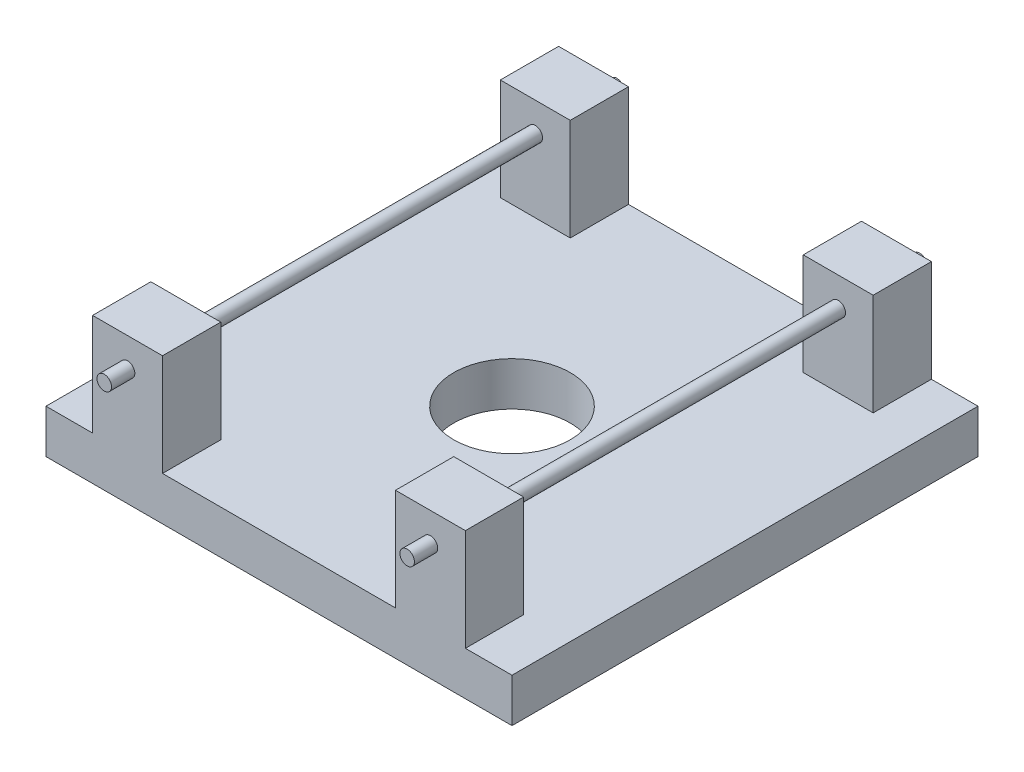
from build123d import *

# Parameters (mm, degrees)
SKETCH3_W                = 50.8
SKETCH3_H                = 50.8
BOSS_EXTRUDE2_DEPTH      = 4.7625
SKETCH4_R                = 6.35
CUT_EXTRUDE2_DEPTH       = 37.235361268
SKETCH5_W                = 7.62
SKETCH5_H                = 50.8
BOSS_EXTRUDE3_DEPTH      = 11.1125
SKETCH6_W                = 7.62
SKETCH6_H                = 38.1
CUT_EXTRUDE3_DEPTH       = 11.1125
BOSS_EXTRUDE4_DEPTH      = 2.54
BOSS_EXTRUDE4_DEPTH_BACK = 53.34
SKETCH7_R                = 0.79375


with BuildPart() as part:
    # Sketch3 → Boss-Extrude2 (new body)
    with BuildSketch(Plane(origin=(0, 0, 0), x_dir=(1, 0, 0), z_dir=(0, 1, 0))):
        Rectangle(SKETCH3_W, SKETCH3_H)
    extrude(amount=BOSS_EXTRUDE2_DEPTH)

    # Sketch4 → Cut-Extrude2 (cut, through all)
    with BuildSketch(Plane(origin=(0, 4.7625, 0), x_dir=(1, 0, 0), z_dir=(0, 1, 0))):
        with Locations(Location((0, 0, 0), (0, 0, 270))):
            Circle(SKETCH4_R)
    extrude(amount=-CUT_EXTRUDE2_DEPTH, mode=Mode.SUBTRACT)

    # Sketch5 → Boss-Extrude3 (add)
    with BuildSketch(Plane(origin=(0, 4.7625, 0), x_dir=(1, 0, 0), z_dir=(0, 1, 0))):
        with Locations((-16.51, 0)):
            Rectangle(SKETCH5_W, SKETCH5_H)
        with Locations((16.51, 0)):
            Rectangle(SKETCH5_W, SKETCH5_H)
    extrude(amount=BOSS_EXTRUDE3_DEPTH)

    # Sketch6 → Cut-Extrude3 (cut)
    with BuildSketch(Plane(origin=(0, 15.875, 0), x_dir=(1, 0, 0), z_dir=(0, 1, 0))):
        with Locations((16.51, 0)):
            Rectangle(SKETCH6_W, SKETCH6_H)
        with Locations((-16.51, 0)):
            Rectangle(SKETCH6_W, SKETCH6_H)
    extrude(amount=-CUT_EXTRUDE3_DEPTH, mode=Mode.SUBTRACT)

    # Sketch7 → Boss-Extrude4 (add, two sides: drawn at the far end of the back side and taken through both)
    with BuildSketch(Plane.XY.offset(25.4).offset(-BOSS_EXTRUDE4_DEPTH_BACK)):
        with Locations((-16.51, 12.7)):
            Circle(SKETCH7_R)
        with Locations(Location((16.51, 12.7, 0), (0, 0, 180))):
            Circle(SKETCH7_R)
    extrude(amount=BOSS_EXTRUDE4_DEPTH + BOSS_EXTRUDE4_DEPTH_BACK)


solid = part.part
